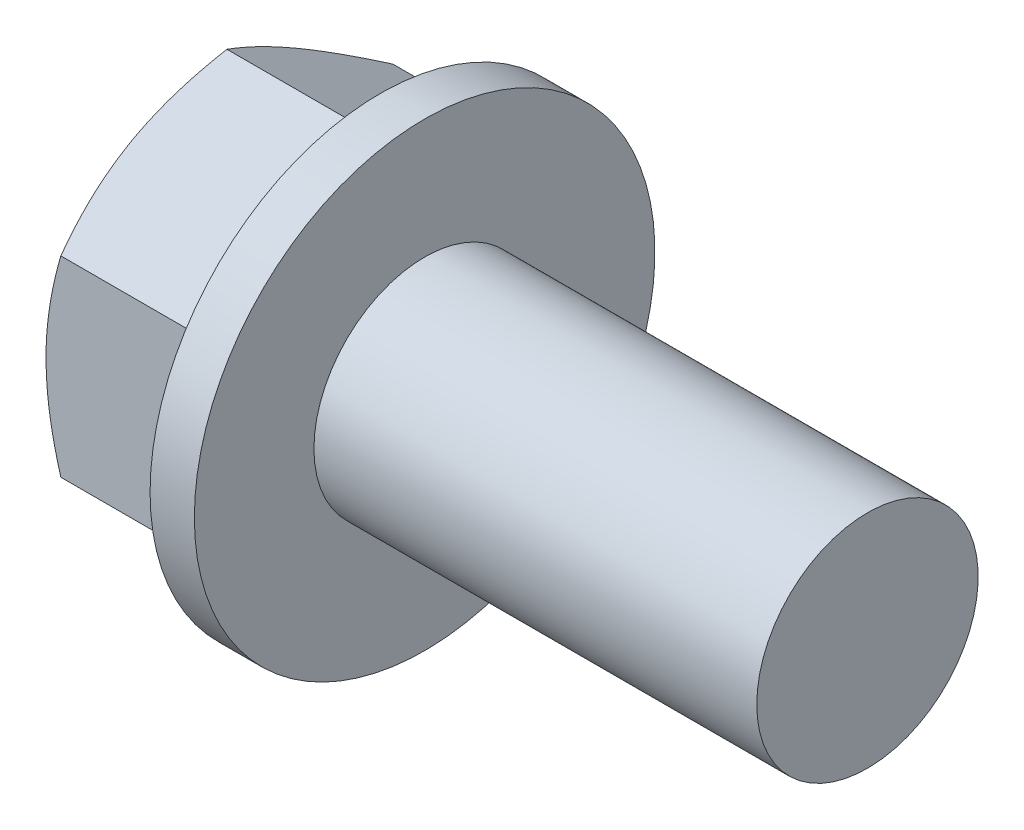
ISO-10303-21;
HEADER;
FILE_DESCRIPTION(('STEP AP214'),'2;1');
FILE_NAME('part.step','',(''),(''),'','','');
FILE_SCHEMA(('AUTOMOTIVE_DESIGN { 1 0 10303 214 1 1 1 1 }'));
ENDSEC;
DATA;
#1=APPLICATION_CONTEXT('core data for automotive mechanical design processes');
#2=APPLICATION_PROTOCOL_DEFINITION('international standard','automotive_design',2000,#1);
#3=PRODUCT_CONTEXT('',#1,'mechanical');
#4=PRODUCT('Part','Part','',(#3));
#5=PRODUCT_RELATED_PRODUCT_CATEGORY('part','',(#4));
#6=PRODUCT_DEFINITION_FORMATION('','',#4);
#7=PRODUCT_DEFINITION_CONTEXT('part definition',#1,'design');
#8=PRODUCT_DEFINITION('design','',#6,#7);
#9=PRODUCT_DEFINITION_SHAPE('','',#8);
#10=(LENGTH_UNIT() NAMED_UNIT(*) SI_UNIT(.MILLI.,.METRE.));
#11=(NAMED_UNIT(*) PLANE_ANGLE_UNIT() SI_UNIT($,.RADIAN.));
#12=(NAMED_UNIT(*) SI_UNIT($,.STERADIAN.) SOLID_ANGLE_UNIT());
#13=UNCERTAINTY_MEASURE_WITH_UNIT(LENGTH_MEASURE(1.E-05),#10,'distance_accuracy_value','');
#14=(GEOMETRIC_REPRESENTATION_CONTEXT(3) GLOBAL_UNCERTAINTY_ASSIGNED_CONTEXT((#13)) GLOBAL_UNIT_ASSIGNED_CONTEXT((#10,
#11,#12)) REPRESENTATION_CONTEXT('',''));
#15=CARTESIAN_POINT('',(0.,0.,0.));
#16=DIRECTION('',(0.,0.,1.));
#17=DIRECTION('',(1.,0.,0.));
#18=AXIS2_PLACEMENT_3D('',#15,#16,#17);
#19=CARTESIAN_POINT('',(0.,0.,0.));
#20=DIRECTION('',(-1.,0.,0.));
#21=DIRECTION('',(0.,0.,1.));
#22=AXIS2_PLACEMENT_3D('',#19,#20,#21);
#23=PLANE('',#22);
#24=CARTESIAN_POINT('',(0.,0.,0.));
#25=DIRECTION('',(-1.,0.,0.));
#26=DIRECTION('',(0.,0.,1.));
#27=AXIS2_PLACEMENT_3D('',#24,#25,#26);
#28=CIRCLE('',#27,4.7625);
#29=CARTESIAN_POINT('',(0.,0.,4.7625));
#30=VERTEX_POINT('',#29);
#31=CARTESIAN_POINT('',(0.,4.12444599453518,2.38125001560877));
#32=VERTEX_POINT('',#31);
#33=EDGE_CURVE('E161',#30,#32,#28,.T.);
#34=ORIENTED_EDGE('',*,*,#33,.T.);
#35=CARTESIAN_POINT('',(0.,4.12444599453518,-2.38125001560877));
#36=VERTEX_POINT('',#35);
#37=EDGE_CURVE('E165',#32,#36,#28,.T.);
#38=ORIENTED_EDGE('',*,*,#37,.T.);
#39=CARTESIAN_POINT('',(0.,0.,-4.7625));
#40=VERTEX_POINT('',#39);
#41=EDGE_CURVE('E367',#36,#40,#28,.T.);
#42=ORIENTED_EDGE('',*,*,#41,.T.);
#43=CARTESIAN_POINT('',(0.,-4.12444599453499,-2.38125001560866));
#44=VERTEX_POINT('',#43);
#45=EDGE_CURVE('E366',#40,#44,#28,.T.);
#46=ORIENTED_EDGE('',*,*,#45,.T.);
#47=CARTESIAN_POINT('',(0.,-4.12444599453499,2.38125001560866));
#48=VERTEX_POINT('',#47);
#49=EDGE_CURVE('E364',#44,#48,#28,.T.);
#50=ORIENTED_EDGE('',*,*,#49,.T.);
#51=EDGE_CURVE('E160',#48,#30,#28,.T.);
#52=ORIENTED_EDGE('',*,*,#51,.T.);
#53=EDGE_LOOP('',(#34,#38,#42,#46,#50,#52));
#54=FACE_BOUND('',#53,.T.);
#55=CARTESIAN_POINT('',(0.,0.,0.));
#56=DIRECTION('',(1.,0.,0.));
#57=DIRECTION('',(0.,0.,-1.));
#58=AXIS2_PLACEMENT_3D('',#55,#56,#57);
#59=CIRCLE('',#58,4.1671875);
#60=CARTESIAN_POINT('',(0.,0.,-4.1671875));
#61=VERTEX_POINT('',#60);
#62=EDGE_CURVE('E128',#61,#61,#59,.T.);
#63=ORIENTED_EDGE('',*,*,#62,.T.);
#64=EDGE_LOOP('',(#63));
#65=FACE_BOUND('',#64,.T.);
#66=ADVANCED_FACE('F28',(#54,#65),#23,.T.);
#67=CARTESIAN_POINT('',(-25.4,0.,0.));
#68=DIRECTION('',(-1.,0.,0.));
#69=DIRECTION('',(0.,0.,1.));
#70=AXIS2_PLACEMENT_3D('',#67,#68,#69);
#71=CYLINDRICAL_SURFACE('',#70,3.175);
#72=CARTESIAN_POINT('',(18.796,0.,0.));
#73=DIRECTION('',(-1.,0.,0.));
#74=DIRECTION('',(0.,0.,1.));
#75=AXIS2_PLACEMENT_3D('',#72,#73,#74);
#76=CIRCLE('',#75,3.175);
#77=CARTESIAN_POINT('',(18.796,0.,3.175));
#78=VERTEX_POINT('',#77);
#79=EDGE_CURVE('E164',#78,#78,#76,.T.);
#80=ORIENTED_EDGE('',*,*,#79,.T.);
#81=EDGE_LOOP('',(#80));
#82=FACE_BOUND('',#81,.T.);
#83=CARTESIAN_POINT('',(6.096,0.,0.));
#84=DIRECTION('',(-1.,0.,0.));
#85=DIRECTION('',(0.,0.,1.));
#86=AXIS2_PLACEMENT_3D('',#83,#84,#85);
#87=CIRCLE('',#86,3.175);
#88=CARTESIAN_POINT('',(6.096,0.,3.175));
#89=VERTEX_POINT('',#88);
#90=EDGE_CURVE('E141',#89,#89,#87,.T.);
#91=ORIENTED_EDGE('',*,*,#90,.F.);
#92=EDGE_LOOP('',(#91));
#93=FACE_BOUND('',#92,.T.);
#94=ADVANCED_FACE('F30',(#82,#93),#71,.T.);
#95=CARTESIAN_POINT('',(18.796,3.175,0.));
#96=DIRECTION('',(1.,0.,0.));
#97=DIRECTION('',(0.,0.,-1.));
#98=AXIS2_PLACEMENT_3D('',#95,#96,#97);
#99=PLANE('',#98);
#100=ORIENTED_EDGE('',*,*,#79,.F.);
#101=EDGE_LOOP('',(#100));
#102=FACE_BOUND('',#101,.T.);
#103=ADVANCED_FACE('F244',(#102),#99,.T.);
#104=CARTESIAN_POINT('',(4.826,5.49942263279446,0.));
#105=DIRECTION('',(-1.,0.,0.));
#106=DIRECTION('',(0.,0.,1.));
#107=AXIS2_PLACEMENT_3D('',#104,#105,#106);
#108=PLANE('',#107);
#109=CARTESIAN_POINT('',(4.826,0.,0.));
#110=DIRECTION('',(-1.,0.,0.));
#111=DIRECTION('',(0.,0.,1.));
#112=AXIS2_PLACEMENT_3D('',#109,#110,#111);
#113=CIRCLE('',#112,6.604);
#114=CARTESIAN_POINT('',(4.826,0.,6.604));
#115=VERTEX_POINT('',#114);
#116=EDGE_CURVE('E157',#115,#115,#113,.T.);
#117=ORIENTED_EDGE('',*,*,#116,.T.);
#118=EDGE_LOOP('',(#117));
#119=FACE_BOUND('',#118,.T.);
#120=DIRECTION('',(0.,1.,0.));
#121=VECTOR('',#120,1.);
#122=CARTESIAN_POINT('',(4.826,-2.74963066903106,4.7625));
#123=LINE('',#122,#121);
#124=CARTESIAN_POINT('',(4.826,-2.74963066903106,4.7625));
#125=VERTEX_POINT('',#124);
#126=CARTESIAN_POINT('',(4.826,2.74963066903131,4.7625));
#127=VERTEX_POINT('',#126);
#128=EDGE_CURVE('E116',#125,#127,#123,.T.);
#129=ORIENTED_EDGE('',*,*,#128,.F.);
#130=DIRECTION('',(0.,0.50000000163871,0.866025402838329));
#131=VECTOR('',#130,1.);
#132=CARTESIAN_POINT('',(4.826,-5.49926133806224,0.));
#133=LINE('',#132,#131);
#134=CARTESIAN_POINT('',(4.826,-5.49926133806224,0.));
#135=VERTEX_POINT('',#134);
#136=EDGE_CURVE('E110',#135,#125,#133,.T.);
#137=ORIENTED_EDGE('',*,*,#136,.F.);
#138=DIRECTION('',(0.,-0.50000000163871,0.866025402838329));
#139=VECTOR('',#138,1.);
#140=CARTESIAN_POINT('',(4.826,-2.74963066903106,-4.7625));
#141=LINE('',#140,#139);
#142=CARTESIAN_POINT('',(4.826,-2.74963066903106,-4.7625));
#143=VERTEX_POINT('',#142);
#144=EDGE_CURVE('E136',#143,#135,#141,.T.);
#145=ORIENTED_EDGE('',*,*,#144,.F.);
#146=DIRECTION('',(0.,-1.,0.));
#147=VECTOR('',#146,1.);
#148=CARTESIAN_POINT('',(4.826,2.74963066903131,-4.7625));
#149=LINE('',#148,#147);
#150=CARTESIAN_POINT('',(4.826,2.74963066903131,-4.7625));
#151=VERTEX_POINT('',#150);
#152=EDGE_CURVE('E133',#151,#143,#149,.T.);
#153=ORIENTED_EDGE('',*,*,#152,.F.);
#154=DIRECTION('',(0.,-0.50000000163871,-0.866025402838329));
#155=VECTOR('',#154,1.);
#156=CARTESIAN_POINT('',(4.826,5.4992613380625,0.));
#157=LINE('',#156,#155);
#158=CARTESIAN_POINT('',(4.826,5.4992613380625,0.));
#159=VERTEX_POINT('',#158);
#160=EDGE_CURVE('E120',#159,#151,#157,.T.);
#161=ORIENTED_EDGE('',*,*,#160,.F.);
#162=DIRECTION('',(0.,0.50000000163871,-0.866025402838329));
#163=VECTOR('',#162,1.);
#164=CARTESIAN_POINT('',(4.826,2.74963066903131,4.7625));
#165=LINE('',#164,#163);
#166=EDGE_CURVE('E106',#127,#159,#165,.T.);
#167=ORIENTED_EDGE('',*,*,#166,.F.);
#168=EDGE_LOOP('',(#129,#137,#145,#153,#161,#167));
#169=FACE_BOUND('',#168,.T.);
#170=ADVANCED_FACE('F114',(#119,#169),#108,.T.);
#171=CARTESIAN_POINT('',(-25.4,0.,0.));
#172=DIRECTION('',(-1.,0.,0.));
#173=DIRECTION('',(0.,0.,1.));
#174=AXIS2_PLACEMENT_3D('',#171,#172,#173);
#175=CYLINDRICAL_SURFACE('',#174,6.604);
#176=CARTESIAN_POINT('',(6.096,0.,0.));
#177=DIRECTION('',(-1.,0.,0.));
#178=DIRECTION('',(0.,0.,1.));
#179=AXIS2_PLACEMENT_3D('',#176,#177,#178);
#180=CIRCLE('',#179,6.604);
#181=CARTESIAN_POINT('',(6.096,0.,6.604));
#182=VERTEX_POINT('',#181);
#183=EDGE_CURVE('E154',#182,#182,#180,.T.);
#184=ORIENTED_EDGE('',*,*,#183,.T.);
#185=EDGE_LOOP('',(#184));
#186=FACE_BOUND('',#185,.T.);
#187=ORIENTED_EDGE('',*,*,#116,.F.);
#188=EDGE_LOOP('',(#187));
#189=FACE_BOUND('',#188,.T.);
#190=ADVANCED_FACE('F253',(#186,#189),#175,.T.);
#191=CARTESIAN_POINT('',(6.096,3.175,0.));
#192=DIRECTION('',(-1.,0.,0.));
#193=DIRECTION('',(0.,0.,1.));
#194=AXIS2_PLACEMENT_3D('',#191,#192,#193);
#195=PLANE('',#194);
#196=ORIENTED_EDGE('',*,*,#183,.F.);
#197=EDGE_LOOP('',(#196));
#198=FACE_BOUND('',#197,.T.);
#199=ORIENTED_EDGE('',*,*,#90,.T.);
#200=EDGE_LOOP('',(#199));
#201=FACE_BOUND('',#200,.T.);
#202=ADVANCED_FACE('F196',(#198,#201),#195,.F.);
#203=CARTESIAN_POINT('',(4.826,-2.74963066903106,4.7625));
#204=DIRECTION('',(0.,0.,1.));
#205=DIRECTION('',(1.,0.,0.));
#206=AXIS2_PLACEMENT_3D('',#203,#204,#205);
#207=PLANE('',#206);
#208=DIRECTION('',(-1.,0.,0.));
#209=VECTOR('',#208,1.);
#210=CARTESIAN_POINT('',(4.826,-2.74963066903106,4.7625));
#211=LINE('',#210,#209);
#212=CARTESIAN_POINT('',(0.425369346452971,-2.74963066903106,4.7625));
#213=VERTEX_POINT('',#212);
#214=EDGE_CURVE('E124',#125,#213,#211,.T.);
#215=ORIENTED_EDGE('',*,*,#214,.F.);
#216=ORIENTED_EDGE('',*,*,#128,.T.);
#217=DIRECTION('',(-1.,0.,0.));
#218=VECTOR('',#217,1.);
#219=CARTESIAN_POINT('',(4.826,2.74963066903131,4.7625));
#220=LINE('',#219,#218);
#221=CARTESIAN_POINT('',(0.425369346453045,2.74963066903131,4.7625));
#222=VERTEX_POINT('',#221);
#223=EDGE_CURVE('E103',#127,#222,#220,.T.);
#224=ORIENTED_EDGE('',*,*,#223,.T.);
#225=CARTESIAN_POINT('',(2.2789896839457,-7.29243864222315,4.7625));
#226=CARTESIAN_POINT('',(2.17794058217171,-7.08333786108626,4.7625));
#227=CARTESIAN_POINT('',(2.07789598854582,-6.87374269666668,4.7625));
#228=CARTESIAN_POINT('',(1.88038982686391,-6.45329629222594,4.7625));
#229=CARTESIAN_POINT('',(1.78292870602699,-6.24244484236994,4.7625));
#230=CARTESIAN_POINT('',(1.59065007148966,-5.81807956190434,4.7625));
#231=CARTESIAN_POINT('',(1.49585087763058,-5.60455740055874,4.7625));
#232=CARTESIAN_POINT('',(1.31032432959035,-5.17575810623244,4.7625));
#233=CARTESIAN_POINT('',(1.21959676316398,-4.96048106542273,4.7625));
#234=CARTESIAN_POINT('',(1.04221901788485,-4.5251571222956,4.7625));
#235=CARTESIAN_POINT('',(0.95563257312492,-4.30508410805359,4.7625));
#236=CARTESIAN_POINT('',(0.789241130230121,-3.86234213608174,4.7625));
#237=CARTESIAN_POINT('',(0.709436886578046,-3.63967289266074,4.7625));
#238=CARTESIAN_POINT('',(0.55875393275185,-3.19184233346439,4.7625));
#239=CARTESIAN_POINT('',(0.487856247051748,-2.96668746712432,4.7625));
#240=CARTESIAN_POINT('',(0.35728975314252,-2.51317453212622,4.7625));
#241=CARTESIAN_POINT('',(0.297617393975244,-2.28481750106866,4.7625));
#242=CARTESIAN_POINT('',(0.192395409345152,-1.82475526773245,4.7625));
#243=CARTESIAN_POINT('',(0.146849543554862,-1.59304919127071,4.7625));
#244=CARTESIAN_POINT('',(0.0729585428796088,-1.126810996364,4.7625));
#245=CARTESIAN_POINT('',(0.0446134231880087,-0.892278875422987,4.7625));
#246=CARTESIAN_POINT('',(0.0168133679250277,-0.540107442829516,4.7625));
#247=CARTESIAN_POINT('',(0.00999820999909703,-0.42301941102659,4.7625));
#248=CARTESIAN_POINT('',(0.00132937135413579,-0.18865445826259,4.7625));
#249=CARTESIAN_POINT('',(-0.000524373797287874,-0.0713775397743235,4.7625));
#250=CARTESIAN_POINT('',(0.000779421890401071,0.163114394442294,4.7625));
#251=CARTESIAN_POINT('',(0.00393554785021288,0.280329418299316,4.7625));
#252=CARTESIAN_POINT('',(0.0151790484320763,0.514524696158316,4.7625));
#253=CARTESIAN_POINT('',(0.023266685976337,0.631504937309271,4.7625));
#254=CARTESIAN_POINT('',(0.0486779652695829,0.915041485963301,4.7625));
#255=CARTESIAN_POINT('',(0.068473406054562,1.08138054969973,4.7625));
#256=CARTESIAN_POINT('',(0.116932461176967,1.41275214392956,4.7625));
#257=CARTESIAN_POINT('',(0.145597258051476,1.57778449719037,4.7625));
#258=CARTESIAN_POINT('',(0.243380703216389,2.07082858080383,4.7625));
#259=CARTESIAN_POINT('',(0.324262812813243,2.39653421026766,4.7625));
#260=CARTESIAN_POINT('',(0.463764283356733,2.88389972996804,4.7625));
#261=CARTESIAN_POINT('',(0.514005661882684,3.04810170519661,4.7625));
#262=CARTESIAN_POINT('',(0.619459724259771,3.37479214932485,4.7625));
#263=CARTESIAN_POINT('',(0.674668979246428,3.53728171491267,4.7625));
#264=CARTESIAN_POINT('',(0.788910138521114,3.85986745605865,4.7625));
#265=CARTESIAN_POINT('',(0.847918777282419,4.01997195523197,4.7625));
#266=CARTESIAN_POINT('',(0.96939955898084,4.33893875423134,4.7625));
#267=CARTESIAN_POINT('',(1.0318731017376,4.49780052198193,4.7625));
#268=CARTESIAN_POINT('',(1.09573716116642,4.65608792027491,4.7625));
#269=B_SPLINE_CURVE_WITH_KNOTS('',3,(#225,#226,#227,#228,#229,#230,#231,#232,#233,#234,#235,
#236,#237,#238,#239,#240,#241,#242,#243,#244,#245,#246,#247,#248,#249,#250,#251,#252,#253,#254,
#255,#256,#257,#258,#259,#260,#261,#262,#263,#264,#265,#266,#267,#268),.UNSPECIFIED.,.F.,.F.,(4,
2,2,2,2,2,2,2,2,2,2,2,2,2,2,2,2,2,2,2,2,4),(0.,0.696720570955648,1.39356097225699,
2.09438908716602,2.79518062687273,3.50457590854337,4.21405000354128,4.92198595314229,
5.62969758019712,6.33759739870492,7.04549784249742,7.39726713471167,7.74903185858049,
8.10069725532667,8.4523814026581,8.95463428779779,9.45695416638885,10.4623537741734,
10.9774624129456,11.4922182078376,12.0040766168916,12.5161433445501),.UNSPECIFIED.);
#270=EDGE_CURVE('E56',#30,#222,#269,.T.);
#271=ORIENTED_EDGE('',*,*,#270,.F.);
#272=EDGE_CURVE('E202',#213,#30,#269,.T.);
#273=ORIENTED_EDGE('',*,*,#272,.F.);
#274=EDGE_LOOP('',(#215,#216,#224,#271,#273));
#275=FACE_BOUND('',#274,.T.);
#276=ADVANCED_FACE('F122',(#275),#207,.T.);
#277=CARTESIAN_POINT('',(4.826,-5.49926133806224,0.));
#278=DIRECTION('',(0.,-0.866025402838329,0.50000000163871));
#279=DIRECTION('',(0.,-0.50000000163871,-0.866025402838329));
#280=AXIS2_PLACEMENT_3D('',#277,#278,#279);
#281=PLANE('',#280);
#282=DIRECTION('',(-1.,0.,0.));
#283=VECTOR('',#282,1.);
#284=CARTESIAN_POINT('',(4.826,-5.49926133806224,0.));
#285=LINE('',#284,#283);
#286=CARTESIAN_POINT('',(0.425369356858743,-5.49926133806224,0.));
#287=VERTEX_POINT('',#286);
#288=EDGE_CURVE('E142',#135,#287,#285,.T.);
#289=ORIENTED_EDGE('',*,*,#288,.F.);
#290=ORIENTED_EDGE('',*,*,#136,.T.);
#291=ORIENTED_EDGE('',*,*,#214,.T.);
#292=CARTESIAN_POINT('',(0.425436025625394,-5.49937680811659,-0.000200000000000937));
#293=CARTESIAN_POINT('',(0.355653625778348,-5.37853891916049,0.209097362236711));
#294=CARTESIAN_POINT('',(0.292183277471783,-5.25666750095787,0.4201848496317));
#295=CARTESIAN_POINT('',(0.181395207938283,-5.01081435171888,0.846014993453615));
#296=CARTESIAN_POINT('',(0.134116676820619,-4.88682825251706,1.060765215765));
#297=CARTESIAN_POINT('',(0.0605335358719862,-4.64037373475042,1.48763696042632));
#298=CARTESIAN_POINT('',(0.0337388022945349,-4.51794369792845,1.69969200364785));
#299=CARTESIAN_POINT('',(0.00971113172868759,-4.33386797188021,2.01852051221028));
#300=CARTESIAN_POINT('',(0.0043946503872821,-4.27246740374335,2.12486941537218));
#301=CARTESIAN_POINT('',(-0.000759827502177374,-4.14960952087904,2.33766550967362));
#302=CARTESIAN_POINT('',(-0.000597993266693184,-4.08815220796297,2.44411269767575));
#303=CARTESIAN_POINT('',(0.00738495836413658,-3.91977562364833,2.73574949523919));
#304=CARTESIAN_POINT('',(0.0207924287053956,-3.8129121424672,2.92084247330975));
#305=CARTESIAN_POINT('',(0.063307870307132,-3.59989442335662,3.2897999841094));
#306=CARTESIAN_POINT('',(0.0924303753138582,-3.49374093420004,3.47366321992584));
#307=CARTESIAN_POINT('',(0.165229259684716,-3.28029402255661,3.84336411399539));
#308=CARTESIAN_POINT('',(0.20921411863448,-3.17302753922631,4.02915511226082));
#309=CARTESIAN_POINT('',(0.309042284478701,-2.96009431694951,4.39796627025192));
#310=CARTESIAN_POINT('',(0.364862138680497,-2.85442485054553,4.58099115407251));
#311=CARTESIAN_POINT('',(0.425436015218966,-2.74951519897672,4.7627));
#312=B_SPLINE_CURVE_WITH_KNOTS('',3,(#292,#293,#294,#295,#296,#297,#298,#299,#300,#301,#302,
#303,#304,#305,#306,#307,#308,#309,#310,#311),.UNSPECIFIED.,.F.,.F.,(4,2,2,2,2,2,2,2,2,4),(0.,
0.754910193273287,1.51163484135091,2.24963135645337,2.61827337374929,2.98690400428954,
3.62867424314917,4.27103903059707,4.9276515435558,5.58297484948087),.UNSPECIFIED.);
#313=EDGE_CURVE('E208',#48,#213,#312,.T.);
#314=ORIENTED_EDGE('',*,*,#313,.F.);
#315=EDGE_CURVE('E372',#287,#48,#312,.T.);
#316=ORIENTED_EDGE('',*,*,#315,.F.);
#317=EDGE_LOOP('',(#289,#290,#291,#314,#316));
#318=FACE_BOUND('',#317,.T.);
#319=ADVANCED_FACE('F195',(#318),#281,.T.);
#320=CARTESIAN_POINT('',(4.826,-2.74963066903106,-4.7625));
#321=DIRECTION('',(0.,-0.866025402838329,-0.50000000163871));
#322=DIRECTION('',(0.,0.50000000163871,-0.866025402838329));
#323=AXIS2_PLACEMENT_3D('',#320,#321,#322);
#324=PLANE('',#323);
#325=DIRECTION('',(-1.,0.,0.));
#326=VECTOR('',#325,1.);
#327=CARTESIAN_POINT('',(4.826,-2.74963066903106,-4.7625));
#328=LINE('',#327,#326);
#329=CARTESIAN_POINT('',(0.425369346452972,-2.74963066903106,-4.7625));
#330=VERTEX_POINT('',#329);
#331=EDGE_CURVE('E145',#143,#330,#328,.T.);
#332=ORIENTED_EDGE('',*,*,#331,.F.);
#333=ORIENTED_EDGE('',*,*,#144,.T.);
#334=ORIENTED_EDGE('',*,*,#288,.T.);
#335=CARTESIAN_POINT('',(0.425436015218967,-2.74951519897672,-4.7627));
#336=CARTESIAN_POINT('',(0.355653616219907,-2.87035308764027,-4.55340263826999));
#337=CARTESIAN_POINT('',(0.292183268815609,-2.99222450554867,-4.34231515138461));
#338=CARTESIAN_POINT('',(0.181395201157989,-3.23807765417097,-3.91648500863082));
#339=CARTESIAN_POINT('',(0.134116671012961,-3.36206375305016,-3.70173478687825));
#340=CARTESIAN_POINT('',(0.0605335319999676,-3.60851827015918,-3.27486304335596));
#341=CARTESIAN_POINT('',(0.0337387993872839,-3.7309483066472,-3.06280800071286));
#342=CARTESIAN_POINT('',(0.00971113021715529,-3.91502403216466,-2.74397949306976));
#343=CARTESIAN_POINT('',(0.00439464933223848,-3.97642460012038,-2.6376305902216));
#344=CARTESIAN_POINT('',(-0.000759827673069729,-4.0992824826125,-2.42483449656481));
#345=CARTESIAN_POINT('',(-0.000597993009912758,-4.16073979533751,-2.31838730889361));
#346=CARTESIAN_POINT('',(0.00738495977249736,-4.32911637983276,-2.02675051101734));
#347=CARTESIAN_POINT('',(0.0207924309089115,-4.43597986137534,-1.84165753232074));
#348=CARTESIAN_POINT('',(0.063307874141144,-4.64899758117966,-1.47270002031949));
#349=CARTESIAN_POINT('',(0.0924303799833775,-4.7551510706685,-1.28883678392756));
#350=CARTESIAN_POINT('',(0.16522926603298,-4.96859798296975,-0.919135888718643));
#351=CARTESIAN_POINT('',(0.209214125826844,-5.07586446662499,-0.733344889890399));
#352=CARTESIAN_POINT('',(0.309042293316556,-5.28879768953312,-0.364533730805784));
#353=CARTESIAN_POINT('',(0.36486214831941,-5.39446715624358,-0.181508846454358));
#354=CARTESIAN_POINT('',(0.425436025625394,-5.49937680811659,0.00019999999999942));
#355=B_SPLINE_CURVE_WITH_KNOTS('',3,(#335,#336,#337,#338,#339,#340,#341,#342,#343,#344,#345,
#346,#347,#348,#349,#350,#351,#352,#353,#354),.UNSPECIFIED.,.F.,.F.,(4,2,2,2,2,2,2,2,2,4),(0.,
0.754910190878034,1.51163483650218,2.2496313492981,2.61827336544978,2.98690399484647,
3.62867423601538,4.27103902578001,4.92765154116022,5.58297484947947),.UNSPECIFIED.);
#356=EDGE_CURVE('E32',#44,#287,#355,.T.);
#357=ORIENTED_EDGE('',*,*,#356,.F.);
#358=EDGE_CURVE('E11',#330,#44,#355,.T.);
#359=ORIENTED_EDGE('',*,*,#358,.F.);
#360=EDGE_LOOP('',(#332,#333,#334,#357,#359));
#361=FACE_BOUND('',#360,.T.);
#362=ADVANCED_FACE('F218',(#361),#324,.T.);
#363=CARTESIAN_POINT('',(4.826,2.74963066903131,-4.7625));
#364=DIRECTION('',(0.,0.,-1.));
#365=DIRECTION('',(-1.,0.,0.));
#366=AXIS2_PLACEMENT_3D('',#363,#364,#365);
#367=PLANE('',#366);
#368=DIRECTION('',(-1.,0.,0.));
#369=VECTOR('',#368,1.);
#370=CARTESIAN_POINT('',(4.826,2.74963066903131,-4.7625));
#371=LINE('',#370,#369);
#372=CARTESIAN_POINT('',(0.425369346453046,2.74963066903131,-4.7625));
#373=VERTEX_POINT('',#372);
#374=EDGE_CURVE('E148',#151,#373,#371,.T.);
#375=ORIENTED_EDGE('',*,*,#374,.F.);
#376=ORIENTED_EDGE('',*,*,#152,.T.);
#377=ORIENTED_EDGE('',*,*,#331,.T.);
#378=CARTESIAN_POINT('',(2.2789896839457,-7.29243864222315,-4.7625));
#379=CARTESIAN_POINT('',(2.17794058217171,-7.08333786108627,-4.7625));
#380=CARTESIAN_POINT('',(2.07789598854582,-6.87374269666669,-4.7625));
#381=CARTESIAN_POINT('',(1.88038982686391,-6.45329629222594,-4.7625));
#382=CARTESIAN_POINT('',(1.782928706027,-6.24244484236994,-4.7625));
#383=CARTESIAN_POINT('',(1.59065007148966,-5.81807956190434,-4.7625));
#384=CARTESIAN_POINT('',(1.49585087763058,-5.60455740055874,-4.7625));
#385=CARTESIAN_POINT('',(1.31032432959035,-5.17575810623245,-4.7625));
#386=CARTESIAN_POINT('',(1.21959676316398,-4.96048106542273,-4.7625));
#387=CARTESIAN_POINT('',(1.04221901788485,-4.52515712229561,-4.7625));
#388=CARTESIAN_POINT('',(0.955632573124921,-4.30508410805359,-4.7625));
#389=CARTESIAN_POINT('',(0.789241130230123,-3.86234213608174,-4.7625));
#390=CARTESIAN_POINT('',(0.709436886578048,-3.63967289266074,-4.7625));
#391=CARTESIAN_POINT('',(0.558753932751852,-3.1918423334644,-4.7625));
#392=CARTESIAN_POINT('',(0.48785624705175,-2.96668746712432,-4.7625));
#393=CARTESIAN_POINT('',(0.357289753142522,-2.51317453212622,-4.7625));
#394=CARTESIAN_POINT('',(0.297617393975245,-2.28481750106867,-4.7625));
#395=CARTESIAN_POINT('',(0.192395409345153,-1.82475526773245,-4.7625));
#396=CARTESIAN_POINT('',(0.146849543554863,-1.59304919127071,-4.7625));
#397=CARTESIAN_POINT('',(0.0729585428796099,-1.126810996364,-4.7625));
#398=CARTESIAN_POINT('',(0.0446134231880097,-0.892278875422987,-4.7625));
#399=CARTESIAN_POINT('',(0.0168133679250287,-0.540107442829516,-4.7625));
#400=CARTESIAN_POINT('',(0.00999820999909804,-0.42301941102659,-4.7625));
#401=CARTESIAN_POINT('',(0.00132937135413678,-0.18865445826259,-4.7625));
#402=CARTESIAN_POINT('',(-0.000524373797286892,-0.0713775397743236,-4.7625));
#403=CARTESIAN_POINT('',(0.000779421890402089,0.163114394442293,-4.7625));
#404=CARTESIAN_POINT('',(0.00393554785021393,0.280329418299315,-4.7625));
#405=CARTESIAN_POINT('',(0.0151790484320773,0.514524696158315,-4.7625));
#406=CARTESIAN_POINT('',(0.023266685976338,0.63150493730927,-4.7625));
#407=CARTESIAN_POINT('',(0.0486779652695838,0.915041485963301,-4.7625));
#408=CARTESIAN_POINT('',(0.068473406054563,1.08138054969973,-4.7625));
#409=CARTESIAN_POINT('',(0.116932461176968,1.41275214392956,-4.7625));
#410=CARTESIAN_POINT('',(0.145597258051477,1.57778449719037,-4.7625));
#411=CARTESIAN_POINT('',(0.24338070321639,2.07082858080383,-4.7625));
#412=CARTESIAN_POINT('',(0.324262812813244,2.39653421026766,-4.7625));
#413=CARTESIAN_POINT('',(0.463764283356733,2.88389972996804,-4.7625));
#414=CARTESIAN_POINT('',(0.514005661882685,3.04810170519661,-4.7625));
#415=CARTESIAN_POINT('',(0.619459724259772,3.37479214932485,-4.7625));
#416=CARTESIAN_POINT('',(0.674668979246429,3.53728171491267,-4.7625));
#417=CARTESIAN_POINT('',(0.788910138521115,3.85986745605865,-4.7625));
#418=CARTESIAN_POINT('',(0.847918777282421,4.01997195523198,-4.7625));
#419=CARTESIAN_POINT('',(0.969399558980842,4.33893875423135,-4.7625));
#420=CARTESIAN_POINT('',(1.0318731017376,4.49780052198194,-4.7625));
#421=CARTESIAN_POINT('',(1.09573716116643,4.65608792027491,-4.7625));
#422=B_SPLINE_CURVE_WITH_KNOTS('',3,(#378,#379,#380,#381,#382,#383,#384,#385,#386,#387,#388,
#389,#390,#391,#392,#393,#394,#395,#396,#397,#398,#399,#400,#401,#402,#403,#404,#405,#406,#407,
#408,#409,#410,#411,#412,#413,#414,#415,#416,#417,#418,#419,#420,#421),.UNSPECIFIED.,.F.,.F.,(4,
2,2,2,2,2,2,2,2,2,2,2,2,2,2,2,2,2,2,2,2,4),(0.,0.696720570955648,1.39356097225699,
2.09438908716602,2.79518062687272,3.50457590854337,4.21405000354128,4.92198595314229,
5.62969758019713,6.33759739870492,7.04549784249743,7.39726713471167,7.74903185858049,
8.10069725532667,8.4523814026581,8.95463428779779,9.45695416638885,10.4623537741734,
10.9774624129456,11.4922182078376,12.0040766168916,12.5161433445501),.UNSPECIFIED.);
#423=EDGE_CURVE('E210',#40,#330,#422,.F.);
#424=ORIENTED_EDGE('',*,*,#423,.F.);
#425=EDGE_CURVE('E203',#373,#40,#422,.F.);
#426=ORIENTED_EDGE('',*,*,#425,.F.);
#427=EDGE_LOOP('',(#375,#376,#377,#424,#426));
#428=FACE_BOUND('',#427,.T.);
#429=ADVANCED_FACE('F215',(#428),#367,.T.);
#430=CARTESIAN_POINT('',(4.826,5.4992613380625,0.));
#431=DIRECTION('',(0.,0.866025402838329,-0.50000000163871));
#432=DIRECTION('',(0.,0.50000000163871,0.866025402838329));
#433=AXIS2_PLACEMENT_3D('',#430,#431,#432);
#434=PLANE('',#433);
#435=DIRECTION('',(-1.,0.,0.));
#436=VECTOR('',#435,1.);
#437=CARTESIAN_POINT('',(4.826,5.4992613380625,0.));
#438=LINE('',#437,#436);
#439=CARTESIAN_POINT('',(0.425369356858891,5.4992613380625,0.));
#440=VERTEX_POINT('',#439);
#441=EDGE_CURVE('E48',#159,#440,#438,.T.);
#442=ORIENTED_EDGE('',*,*,#441,.F.);
#443=ORIENTED_EDGE('',*,*,#160,.T.);
#444=ORIENTED_EDGE('',*,*,#374,.T.);
#445=CARTESIAN_POINT('',(0.425436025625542,5.49937680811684,0.000199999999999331));
#446=CARTESIAN_POINT('',(0.355653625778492,5.37853891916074,-0.209097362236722));
#447=CARTESIAN_POINT('',(0.292183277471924,5.25666750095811,-0.420184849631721));
#448=CARTESIAN_POINT('',(0.181395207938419,5.01081435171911,-0.846014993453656));
#449=CARTESIAN_POINT('',(0.134116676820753,4.88682825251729,-1.06076521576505));
#450=CARTESIAN_POINT('',(0.0605335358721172,4.64037373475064,-1.48763696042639));
#451=CARTESIAN_POINT('',(0.0337388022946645,4.51794369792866,-1.69969200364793));
#452=CARTESIAN_POINT('',(0.009711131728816,4.33386797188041,-2.01852051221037));
#453=CARTESIAN_POINT('',(0.00439465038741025,4.27246740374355,-2.12486941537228));
#454=CARTESIAN_POINT('',(-0.000759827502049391,4.14960952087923,-2.33766550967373));
#455=CARTESIAN_POINT('',(-0.000597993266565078,4.08815220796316,-2.44411269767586));
#456=CARTESIAN_POINT('',(0.00738495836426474,3.91977562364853,-2.7357494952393));
#457=CARTESIAN_POINT('',(0.0207924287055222,3.8129121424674,-2.92084247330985));
#458=CARTESIAN_POINT('',(0.0633078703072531,3.59989442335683,-3.28979998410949));
#459=CARTESIAN_POINT('',(0.0924303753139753,3.49374093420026,-3.47366321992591));
#460=CARTESIAN_POINT('',(0.165229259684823,3.28029402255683,-3.84336411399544));
#461=CARTESIAN_POINT('',(0.209214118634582,3.17302753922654,-4.02915511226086));
#462=CARTESIAN_POINT('',(0.30904228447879,2.96009431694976,-4.39796627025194));
#463=CARTESIAN_POINT('',(0.364862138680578,2.85442485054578,-4.58099115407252));
#464=CARTESIAN_POINT('',(0.425436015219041,2.74951519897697,-4.7627));
#465=B_SPLINE_CURVE_WITH_KNOTS('',3,(#445,#446,#447,#448,#449,#450,#451,#452,#453,#454,#455,
#456,#457,#458,#459,#460,#461,#462,#463,#464),.UNSPECIFIED.,.F.,.F.,(4,2,2,2,2,2,2,2,2,4),(0.,
0.754910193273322,1.51163484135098,2.24963135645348,2.61827337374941,2.98690400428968,
3.62867424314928,4.27103903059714,4.92765154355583,5.58297484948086),.UNSPECIFIED.);
#466=EDGE_CURVE('E209',#36,#373,#465,.T.);
#467=ORIENTED_EDGE('',*,*,#466,.F.);
#468=EDGE_CURVE('E175',#440,#36,#465,.T.);
#469=ORIENTED_EDGE('',*,*,#468,.F.);
#470=EDGE_LOOP('',(#442,#443,#444,#467,#469));
#471=FACE_BOUND('',#470,.T.);
#472=ADVANCED_FACE('F189',(#471),#434,.T.);
#473=CARTESIAN_POINT('',(4.826,2.74963066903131,4.7625));
#474=DIRECTION('',(0.,0.866025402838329,0.50000000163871));
#475=DIRECTION('',(0.,-0.50000000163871,0.866025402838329));
#476=AXIS2_PLACEMENT_3D('',#473,#474,#475);
#477=PLANE('',#476);
#478=ORIENTED_EDGE('',*,*,#223,.F.);
#479=ORIENTED_EDGE('',*,*,#166,.T.);
#480=ORIENTED_EDGE('',*,*,#441,.T.);
#481=CARTESIAN_POINT('',(0.425436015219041,2.74951519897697,4.7627));
#482=CARTESIAN_POINT('',(0.355653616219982,2.87035308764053,4.55340263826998));
#483=CARTESIAN_POINT('',(0.292183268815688,2.99222450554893,4.34231515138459));
#484=CARTESIAN_POINT('',(0.181395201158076,3.23807765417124,3.9164850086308));
#485=CARTESIAN_POINT('',(0.134116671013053,3.36206375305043,3.70173478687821));
#486=CARTESIAN_POINT('',(0.0605335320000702,3.60851827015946,3.27486304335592));
#487=CARTESIAN_POINT('',(0.0337387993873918,3.73094830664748,3.06280800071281));
#488=CARTESIAN_POINT('',(0.0097111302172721,3.91502403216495,2.7439794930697));
#489=CARTESIAN_POINT('',(0.00439464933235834,3.97642460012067,2.63763059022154));
#490=CARTESIAN_POINT('',(-0.000759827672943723,4.09928248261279,2.42483449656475));
#491=CARTESIAN_POINT('',(-0.00059799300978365,4.1607397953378,2.31838730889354));
#492=CARTESIAN_POINT('',(0.00738495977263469,4.32911637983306,2.02675051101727));
#493=CARTESIAN_POINT('',(0.0207924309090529,4.43597986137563,1.84165753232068));
#494=CARTESIAN_POINT('',(0.0633078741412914,4.64899758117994,1.47270002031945));
#495=CARTESIAN_POINT('',(0.0924303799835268,4.75515107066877,1.28883678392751));
#496=CARTESIAN_POINT('',(0.165229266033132,4.96859798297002,0.919135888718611));
#497=CARTESIAN_POINT('',(0.209214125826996,5.07586446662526,0.733344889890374));
#498=CARTESIAN_POINT('',(0.309042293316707,5.28879768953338,0.364533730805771));
#499=CARTESIAN_POINT('',(0.36486214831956,5.39446715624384,0.181508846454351));
#500=CARTESIAN_POINT('',(0.425436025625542,5.49937680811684,-0.000200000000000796));
#501=B_SPLINE_CURVE_WITH_KNOTS('',3,(#481,#482,#483,#484,#485,#486,#487,#488,#489,#490,#491,
#492,#493,#494,#495,#496,#497,#498,#499,#500),.UNSPECIFIED.,.F.,.F.,(4,2,2,2,2,2,2,2,2,4),(0.,
0.75491019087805,1.51163483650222,2.24963134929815,2.61827336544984,2.98690399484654,
3.62867423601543,4.27103902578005,4.92765154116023,5.58297484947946),.UNSPECIFIED.);
#502=EDGE_CURVE('E168',#32,#440,#501,.T.);
#503=ORIENTED_EDGE('',*,*,#502,.F.);
#504=EDGE_CURVE('E108',#222,#32,#501,.T.);
#505=ORIENTED_EDGE('',*,*,#504,.F.);
#506=EDGE_LOOP('',(#478,#479,#480,#503,#505));
#507=FACE_BOUND('',#506,.T.);
#508=ADVANCED_FACE('F105',(#507),#477,.T.);
#509=CARTESIAN_POINT('',(0.,0.,0.));
#510=DIRECTION('',(1.,0.,0.));
#511=DIRECTION('',(0.,0.,-1.));
#512=AXIS2_PLACEMENT_3D('',#509,#510,#511);
#513=CONICAL_SURFACE('',#512,4.7625,1.0471975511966);
#514=ORIENTED_EDGE('',*,*,#51,.F.);
#515=ORIENTED_EDGE('',*,*,#313,.T.);
#516=ORIENTED_EDGE('',*,*,#272,.T.);
#517=EDGE_LOOP('',(#514,#515,#516));
#518=FACE_BOUND('',#517,.T.);
#519=ADVANCED_FACE('F188',(#518),#513,.T.);
#520=ORIENTED_EDGE('',*,*,#49,.F.);
#521=ORIENTED_EDGE('',*,*,#356,.T.);
#522=ORIENTED_EDGE('',*,*,#315,.T.);
#523=EDGE_LOOP('',(#520,#521,#522));
#524=FACE_BOUND('',#523,.T.);
#525=ADVANCED_FACE('F302',(#524),#513,.T.);
#526=ORIENTED_EDGE('',*,*,#423,.T.);
#527=ORIENTED_EDGE('',*,*,#358,.T.);
#528=ORIENTED_EDGE('',*,*,#45,.F.);
#529=EDGE_LOOP('',(#526,#527,#528));
#530=FACE_BOUND('',#529,.T.);
#531=ADVANCED_FACE('F181',(#530),#513,.T.);
#532=ORIENTED_EDGE('',*,*,#466,.T.);
#533=ORIENTED_EDGE('',*,*,#425,.T.);
#534=ORIENTED_EDGE('',*,*,#41,.F.);
#535=EDGE_LOOP('',(#532,#533,#534));
#536=FACE_BOUND('',#535,.T.);
#537=ADVANCED_FACE('F288',(#536),#513,.T.);
#538=ORIENTED_EDGE('',*,*,#33,.F.);
#539=ORIENTED_EDGE('',*,*,#270,.T.);
#540=ORIENTED_EDGE('',*,*,#504,.T.);
#541=EDGE_LOOP('',(#538,#539,#540));
#542=FACE_BOUND('',#541,.T.);
#543=ADVANCED_FACE('F281',(#542),#513,.T.);
#544=ORIENTED_EDGE('',*,*,#502,.T.);
#545=ORIENTED_EDGE('',*,*,#468,.T.);
#546=ORIENTED_EDGE('',*,*,#37,.F.);
#547=EDGE_LOOP('',(#544,#545,#546));
#548=FACE_BOUND('',#547,.T.);
#549=ADVANCED_FACE('F231',(#548),#513,.T.);
#550=CARTESIAN_POINT('',(0.60325,0.,0.));
#551=DIRECTION('',(-1.,0.,0.));
#552=DIRECTION('',(0.,0.,1.));
#553=AXIS2_PLACEMENT_3D('',#550,#551,#552);
#554=CYLINDRICAL_SURFACE('',#553,4.1671875);
#555=CARTESIAN_POINT('',(0.60325,0.,0.));
#556=DIRECTION('',(1.,0.,0.));
#557=DIRECTION('',(0.,0.,-1.));
#558=AXIS2_PLACEMENT_3D('',#555,#556,#557);
#559=CIRCLE('',#558,4.1671875);
#560=CARTESIAN_POINT('',(0.60325,0.,-4.1671875));
#561=VERTEX_POINT('',#560);
#562=EDGE_CURVE('E125',#561,#561,#559,.T.);
#563=ORIENTED_EDGE('',*,*,#562,.T.);
#564=EDGE_LOOP('',(#563));
#565=FACE_BOUND('',#564,.T.);
#566=ORIENTED_EDGE('',*,*,#62,.F.);
#567=EDGE_LOOP('',(#566));
#568=FACE_BOUND('',#567,.T.);
#569=ADVANCED_FACE('F227',(#565,#568),#554,.F.);
#570=CARTESIAN_POINT('',(0.60325,0.,0.));
#571=DIRECTION('',(1.,0.,0.));
#572=DIRECTION('',(0.,0.,-1.));
#573=AXIS2_PLACEMENT_3D('',#570,#571,#572);
#574=PLANE('',#573);
#575=ORIENTED_EDGE('',*,*,#562,.F.);
#576=EDGE_LOOP('',(#575));
#577=FACE_BOUND('',#576,.T.);
#578=ADVANCED_FACE('F230',(#577),#574,.F.);
#579=CLOSED_SHELL('',(#66,#94,#103,#170,#190,#202,#276,#319,#362,#429,#472,#508,#519,#525,#531,
#537,#543,#549,#569,#578));
#580=MANIFOLD_SOLID_BREP('B2',#579);
#581=ADVANCED_BREP_SHAPE_REPRESENTATION('',(#18,#580),#14);
#582=SHAPE_DEFINITION_REPRESENTATION(#9,#581);
ENDSEC;
END-ISO-10303-21;
